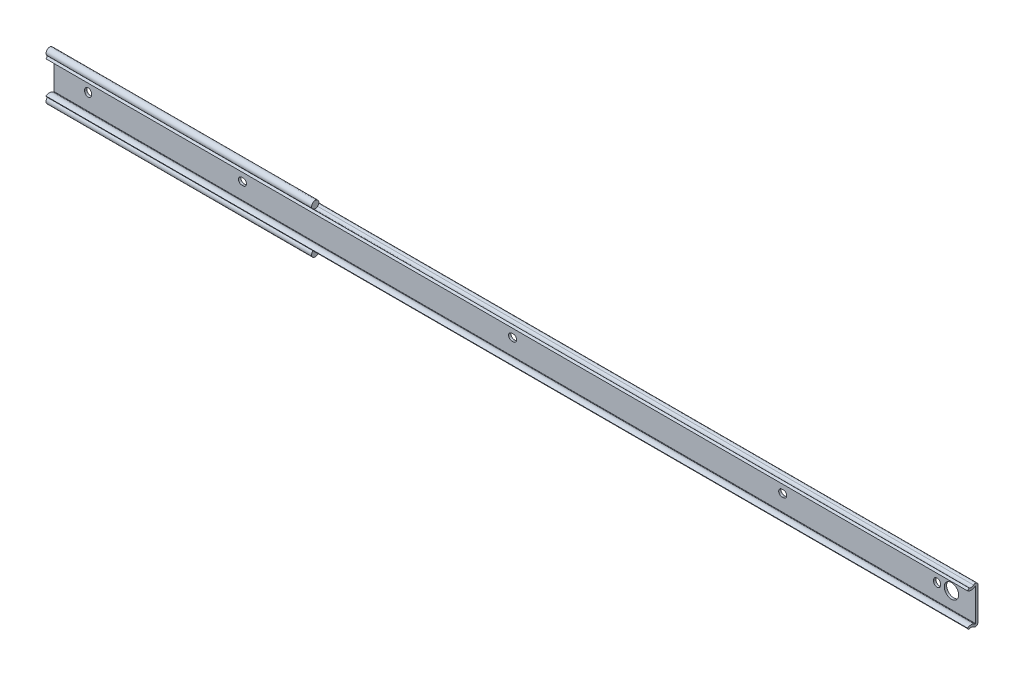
ISO-10303-21;
HEADER;
FILE_DESCRIPTION(('STEP AP214'),'2;1');
FILE_NAME('part.step','',(''),(''),'','','');
FILE_SCHEMA(('AUTOMOTIVE_DESIGN { 1 0 10303 214 1 1 1 1 }'));
ENDSEC;
DATA;
#1=APPLICATION_CONTEXT('core data for automotive mechanical design processes');
#2=APPLICATION_PROTOCOL_DEFINITION('international standard','automotive_design',2000,#1);
#3=PRODUCT_CONTEXT('',#1,'mechanical');
#4=PRODUCT('Part','Part','',(#3));
#5=PRODUCT_RELATED_PRODUCT_CATEGORY('part','',(#4));
#6=PRODUCT_DEFINITION_FORMATION('','',#4);
#7=PRODUCT_DEFINITION_CONTEXT('part definition',#1,'design');
#8=PRODUCT_DEFINITION('design','',#6,#7);
#9=PRODUCT_DEFINITION_SHAPE('','',#8);
#10=(LENGTH_UNIT() NAMED_UNIT(*) SI_UNIT(.MILLI.,.METRE.));
#11=(NAMED_UNIT(*) PLANE_ANGLE_UNIT() SI_UNIT($,.RADIAN.));
#12=(NAMED_UNIT(*) SI_UNIT($,.STERADIAN.) SOLID_ANGLE_UNIT());
#13=UNCERTAINTY_MEASURE_WITH_UNIT(LENGTH_MEASURE(1.E-05),#10,'distance_accuracy_value','');
#14=(GEOMETRIC_REPRESENTATION_CONTEXT(3) GLOBAL_UNCERTAINTY_ASSIGNED_CONTEXT((#13)) GLOBAL_UNIT_ASSIGNED_CONTEXT((#10,
#11,#12)) REPRESENTATION_CONTEXT('',''));
#15=CARTESIAN_POINT('',(0.,0.,0.));
#16=DIRECTION('',(0.,0.,1.));
#17=DIRECTION('',(1.,0.,0.));
#18=AXIS2_PLACEMENT_3D('',#15,#16,#17);
#19=CARTESIAN_POINT('',(584.2,10.6847650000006,1.74000019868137));
#20=DIRECTION('',(-1.,0.,0.));
#21=DIRECTION('',(0.,0.,1.));
#22=AXIS2_PLACEMENT_3D('',#19,#20,#21);
#23=CYLINDRICAL_SURFACE('',#22,1.7400001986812);
#24=CARTESIAN_POINT('',(-22.4,10.6847650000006,1.74000019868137));
#25=DIRECTION('',(1.,0.,0.));
#26=DIRECTION('',(0.,0.,-1.));
#27=AXIS2_PLACEMENT_3D('',#24,#25,#26);
#28=CIRCLE('',#27,1.7400001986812);
#29=CARTESIAN_POINT('',(-22.4,12.421670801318,1.84372545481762));
#30=VERTEX_POINT('',#29);
#31=CARTESIAN_POINT('',(-22.4,12.1726708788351,2.64207380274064));
#32=VERTEX_POINT('',#31);
#33=EDGE_CURVE('E275',#30,#32,#28,.T.);
#34=ORIENTED_EDGE('',*,*,#33,.T.);
#35=DIRECTION('',(-1.,0.,0.));
#36=VECTOR('',#35,1.);
#37=CARTESIAN_POINT('',(65.,12.1726708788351,2.64207380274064));
#38=LINE('',#37,#36);
#39=CARTESIAN_POINT('',(152.4,12.1726708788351,2.64207380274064));
#40=VERTEX_POINT('',#39);
#41=EDGE_CURVE('E492',#32,#40,#38,.F.);
#42=ORIENTED_EDGE('',*,*,#41,.T.);
#43=CARTESIAN_POINT('',(152.4,10.6847650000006,1.74000019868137));
#44=DIRECTION('',(-1.,0.,0.));
#45=DIRECTION('',(0.,0.,1.));
#46=AXIS2_PLACEMENT_3D('',#43,#44,#45);
#47=CIRCLE('',#46,1.7400001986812);
#48=CARTESIAN_POINT('',(152.4,11.9768810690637,2.90534853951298));
#49=VERTEX_POINT('',#48);
#50=EDGE_CURVE('E488',#49,#40,#47,.T.);
#51=ORIENTED_EDGE('',*,*,#50,.F.);
#52=DIRECTION('',(-1.,0.,0.));
#53=VECTOR('',#52,1.);
#54=CARTESIAN_POINT('',(584.2,11.9768810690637,2.90534853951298));
#55=LINE('',#54,#53);
#56=CARTESIAN_POINT('',(584.2,11.9768810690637,2.90534853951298));
#57=VERTEX_POINT('',#56);
#58=EDGE_CURVE('E365',#57,#49,#55,.T.);
#59=ORIENTED_EDGE('',*,*,#58,.F.);
#60=CARTESIAN_POINT('',(584.2,10.6847650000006,1.74000019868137));
#61=DIRECTION('',(1.,0.,0.));
#62=DIRECTION('',(0.,0.,-1.));
#63=AXIS2_PLACEMENT_3D('',#60,#61,#62);
#64=CIRCLE('',#63,1.7400001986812);
#65=CARTESIAN_POINT('',(584.2,12.421670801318,1.84372545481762));
#66=VERTEX_POINT('',#65);
#67=EDGE_CURVE('E272',#66,#57,#64,.T.);
#68=ORIENTED_EDGE('',*,*,#67,.F.);
#69=CARTESIAN_POINT('',(584.2,10.6847650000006,1.74000019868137));
#70=DIRECTION('',(-1.,0.,0.));
#71=DIRECTION('',(0.,0.998221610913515,0.0596122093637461));
#72=AXIS2_PLACEMENT_3D('',#69,#70,#71);
#73=CIRCLE('',#72,1.7400001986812);
#74=CARTESIAN_POINT('',(584.2,12.421670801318,1.63627494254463));
#75=VERTEX_POINT('',#74);
#76=EDGE_CURVE('E263',#66,#75,#73,.T.);
#77=ORIENTED_EDGE('',*,*,#76,.T.);
#78=CARTESIAN_POINT('',(584.2,10.6847650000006,0.));
#79=VERTEX_POINT('',#78);
#80=EDGE_CURVE('E260',#79,#75,#64,.T.);
#81=ORIENTED_EDGE('',*,*,#80,.F.);
#82=DIRECTION('',(-1.,0.,0.));
#83=VECTOR('',#82,1.);
#84=CARTESIAN_POINT('',(584.2,10.6847650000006,0.));
#85=LINE('',#84,#83);
#86=CARTESIAN_POINT('',(-22.4,10.6847650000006,0.));
#87=VERTEX_POINT('',#86);
#88=EDGE_CURVE('E397',#79,#87,#85,.T.);
#89=ORIENTED_EDGE('',*,*,#88,.T.);
#90=CARTESIAN_POINT('',(-22.4,12.421670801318,1.63627494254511));
#91=VERTEX_POINT('',#90);
#92=EDGE_CURVE('E292',#87,#91,#28,.T.);
#93=ORIENTED_EDGE('',*,*,#92,.T.);
#94=CARTESIAN_POINT('',(-22.4,10.6847650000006,1.74000019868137));
#95=DIRECTION('',(1.,0.,0.));
#96=DIRECTION('',(0.,0.998221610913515,-0.0596122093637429));
#97=AXIS2_PLACEMENT_3D('',#94,#95,#96);
#98=CIRCLE('',#97,1.7400001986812);
#99=EDGE_CURVE('E289',#91,#30,#98,.T.);
#100=ORIENTED_EDGE('',*,*,#99,.T.);
#101=EDGE_LOOP('',(#34,#42,#51,#59,#68,#77,#81,#89,#93,#100));
#102=FACE_BOUND('',#101,.T.);
#103=ADVANCED_FACE('F14',(#102),#23,.T.);
#104=CARTESIAN_POINT('',(584.2,10.6847650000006,1.74000019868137));
#105=DIRECTION('',(1.,0.,0.));
#106=DIRECTION('',(0.,0.,-1.));
#107=AXIS2_PLACEMENT_3D('',#104,#105,#106);
#108=PLANE('',#107);
#109=DIRECTION('',(0.,1.,0.));
#110=VECTOR('',#109,1.);
#111=CARTESIAN_POINT('',(584.2,-10.6847650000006,0.));
#112=LINE('',#111,#110);
#113=CARTESIAN_POINT('',(584.2,-10.6847650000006,0.));
#114=VERTEX_POINT('',#113);
#115=EDGE_CURVE('E267',#114,#79,#112,.T.);
#116=ORIENTED_EDGE('',*,*,#115,.T.);
#117=ORIENTED_EDGE('',*,*,#80,.T.);
#118=ORIENTED_EDGE('',*,*,#76,.F.);
#119=ORIENTED_EDGE('',*,*,#67,.T.);
#120=CARTESIAN_POINT('',(584.2,13.7450000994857,4.50000028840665));
#121=DIRECTION('',(-1.,0.,0.));
#122=DIRECTION('',(0.,0.,-1.));
#123=AXIS2_PLACEMENT_3D('',#120,#121,#122);
#124=CIRCLE('',#123,2.38099960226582);
#125=CARTESIAN_POINT('',(584.2,11.8434490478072,5.93292132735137));
#126=VERTEX_POINT('',#125);
#127=EDGE_CURVE('E271',#57,#126,#124,.T.);
#128=ORIENTED_EDGE('',*,*,#127,.T.);
#129=DIRECTION('',(0.,-0.798635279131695,0.601815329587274));
#130=VECTOR('',#129,1.);
#131=CARTESIAN_POINT('',(584.2,10.6055642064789,6.86573520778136));
#132=LINE('',#131,#130);
#133=CARTESIAN_POINT('',(584.2,10.6055642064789,6.86573520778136));
#134=VERTEX_POINT('',#133);
#135=EDGE_CURVE('E415',#126,#134,#132,.T.);
#136=ORIENTED_EDGE('',*,*,#135,.T.);
#137=CARTESIAN_POINT('',(584.2,13.7450000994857,4.50000028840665));
#138=DIRECTION('',(1.,0.,0.));
#139=DIRECTION('',(0.,0.,-1.));
#140=AXIS2_PLACEMENT_3D('',#137,#138,#139);
#141=CIRCLE('',#140,3.9309998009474);
#142=CARTESIAN_POINT('',(584.2,10.8258581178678,1.86725086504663));
#143=VERTEX_POINT('',#142);
#144=EDGE_CURVE('E414',#134,#143,#141,.T.);
#145=ORIENTED_EDGE('',*,*,#144,.T.);
#146=CARTESIAN_POINT('',(584.2,10.6847650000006,1.74000019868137));
#147=DIRECTION('',(-1.,0.,0.));
#148=DIRECTION('',(0.,0.,-1.));
#149=AXIS2_PLACEMENT_3D('',#146,#147,#148);
#150=CIRCLE('',#149,0.18999999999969);
#151=CARTESIAN_POINT('',(584.2,10.6847650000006,1.55000019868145));
#152=VERTEX_POINT('',#151);
#153=EDGE_CURVE('E412',#143,#152,#150,.T.);
#154=ORIENTED_EDGE('',*,*,#153,.T.);
#155=DIRECTION('',(0.,-1.,0.));
#156=VECTOR('',#155,1.);
#157=CARTESIAN_POINT('',(584.2,-10.6847650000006,1.55000019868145));
#158=LINE('',#157,#156);
#159=CARTESIAN_POINT('',(584.2,-10.6847650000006,1.55000019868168));
#160=VERTEX_POINT('',#159);
#161=EDGE_CURVE('E410',#152,#160,#158,.T.);
#162=ORIENTED_EDGE('',*,*,#161,.T.);
#163=CARTESIAN_POINT('',(584.2,-10.6847650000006,1.74000019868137));
#164=DIRECTION('',(-1.,0.,0.));
#165=DIRECTION('',(0.,0.,1.));
#166=AXIS2_PLACEMENT_3D('',#163,#164,#165);
#167=CIRCLE('',#166,0.18999999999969);
#168=CARTESIAN_POINT('',(584.2,-10.8258581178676,1.86725086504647));
#169=VERTEX_POINT('',#168);
#170=EDGE_CURVE('E408',#160,#169,#167,.T.);
#171=ORIENTED_EDGE('',*,*,#170,.T.);
#172=CARTESIAN_POINT('',(584.2,-13.7450000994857,4.50000028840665));
#173=DIRECTION('',(1.,0.,0.));
#174=DIRECTION('',(0.,0.,1.));
#175=AXIS2_PLACEMENT_3D('',#172,#173,#174);
#176=CIRCLE('',#175,3.9309998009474);
#177=CARTESIAN_POINT('',(584.2,-10.6055642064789,6.86573520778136));
#178=VERTEX_POINT('',#177);
#179=EDGE_CURVE('E406',#169,#178,#176,.T.);
#180=ORIENTED_EDGE('',*,*,#179,.T.);
#181=DIRECTION('',(0.,-0.798635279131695,-0.601815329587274));
#182=VECTOR('',#181,1.);
#183=CARTESIAN_POINT('',(584.2,-10.6055642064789,6.86573520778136));
#184=LINE('',#183,#182);
#185=CARTESIAN_POINT('',(584.2,-11.8434490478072,5.93292132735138));
#186=VERTEX_POINT('',#185);
#187=EDGE_CURVE('E404',#178,#186,#184,.T.);
#188=ORIENTED_EDGE('',*,*,#187,.T.);
#189=CARTESIAN_POINT('',(584.2,-13.7450000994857,4.50000028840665));
#190=DIRECTION('',(-1.,0.,0.));
#191=DIRECTION('',(0.,0.,1.));
#192=AXIS2_PLACEMENT_3D('',#189,#190,#191);
#193=CIRCLE('',#192,2.38099960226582);
#194=CARTESIAN_POINT('',(584.2,-11.9768810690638,2.90534853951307));
#195=VERTEX_POINT('',#194);
#196=EDGE_CURVE('E402',#186,#195,#193,.T.);
#197=ORIENTED_EDGE('',*,*,#196,.T.);
#198=CARTESIAN_POINT('',(584.2,-10.6847650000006,1.74000019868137));
#199=DIRECTION('',(1.,0.,0.));
#200=DIRECTION('',(0.,0.,1.));
#201=AXIS2_PLACEMENT_3D('',#198,#199,#200);
#202=CIRCLE('',#201,1.7400001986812);
#203=EDGE_CURVE('E400',#195,#114,#202,.T.);
#204=ORIENTED_EDGE('',*,*,#203,.T.);
#205=EDGE_LOOP('',(#116,#117,#118,#119,#128,#136,#145,#154,#162,#171,#180,#188,#197,#204));
#206=FACE_BOUND('',#205,.T.);
#207=ADVANCED_FACE('F262',(#206),#108,.T.);
#208=CARTESIAN_POINT('',(-22.4,10.6847650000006,1.74000019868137));
#209=DIRECTION('',(1.,0.,0.));
#210=DIRECTION('',(0.,0.,-1.));
#211=AXIS2_PLACEMENT_3D('',#208,#209,#210);
#212=PLANE('',#211);
#213=CARTESIAN_POINT('',(-22.4,13.745,4.45));
#214=DIRECTION('',(-1.,0.,0.));
#215=DIRECTION('',(0.,0.,1.));
#216=AXIS2_PLACEMENT_3D('',#213,#214,#215);
#217=CIRCLE('',#216,2.396);
#218=CARTESIAN_POINT('',(-22.4,11.4666473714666,5.19156948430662));
#219=VERTEX_POINT('',#218);
#220=EDGE_CURVE('E484',#219,#32,#217,.T.);
#221=ORIENTED_EDGE('',*,*,#220,.T.);
#222=ORIENTED_EDGE('',*,*,#33,.F.);
#223=ORIENTED_EDGE('',*,*,#99,.F.);
#224=ORIENTED_EDGE('',*,*,#92,.F.);
#225=DIRECTION('',(0.,1.,0.));
#226=VECTOR('',#225,1.);
#227=CARTESIAN_POINT('',(-22.4,-10.6847650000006,0.));
#228=LINE('',#227,#226);
#229=CARTESIAN_POINT('',(-22.4,-10.6847650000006,0.));
#230=VERTEX_POINT('',#229);
#231=EDGE_CURVE('E318',#230,#87,#228,.T.);
#232=ORIENTED_EDGE('',*,*,#231,.F.);
#233=CARTESIAN_POINT('',(-22.4,-10.6847650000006,1.74000019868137));
#234=DIRECTION('',(1.,0.,0.));
#235=DIRECTION('',(0.,0.,1.));
#236=AXIS2_PLACEMENT_3D('',#233,#234,#235);
#237=CIRCLE('',#236,1.7400001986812);
#238=CARTESIAN_POINT('',(-22.4,-12.1726708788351,2.64207380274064));
#239=VERTEX_POINT('',#238);
#240=EDGE_CURVE('E316',#239,#230,#237,.T.);
#241=ORIENTED_EDGE('',*,*,#240,.F.);
#242=CARTESIAN_POINT('',(-22.4,-13.745,4.45));
#243=DIRECTION('',(-1.,0.,0.));
#244=DIRECTION('',(0.,0.,-1.));
#245=AXIS2_PLACEMENT_3D('',#242,#243,#244);
#246=CIRCLE('',#245,2.396);
#247=CARTESIAN_POINT('',(-22.4,-11.4666473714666,5.19156948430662));
#248=VERTEX_POINT('',#247);
#249=EDGE_CURVE('E466',#239,#248,#246,.T.);
#250=ORIENTED_EDGE('',*,*,#249,.T.);
#251=CARTESIAN_POINT('',(-22.4,-13.7450000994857,4.50000028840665));
#252=DIRECTION('',(-1.,0.,0.));
#253=DIRECTION('',(0.,0.,1.));
#254=AXIS2_PLACEMENT_3D('',#251,#252,#253);
#255=CIRCLE('',#254,2.38099960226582);
#256=CARTESIAN_POINT('',(-22.4,-11.8434490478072,5.93292132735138));
#257=VERTEX_POINT('',#256);
#258=EDGE_CURVE('E37',#257,#248,#255,.T.);
#259=ORIENTED_EDGE('',*,*,#258,.F.);
#260=DIRECTION('',(0.,-0.798635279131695,-0.601815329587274));
#261=VECTOR('',#260,1.);
#262=CARTESIAN_POINT('',(-22.4,-10.6055642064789,6.86573520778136));
#263=LINE('',#262,#261);
#264=CARTESIAN_POINT('',(-22.4,-10.6055642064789,6.86573520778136));
#265=VERTEX_POINT('',#264);
#266=EDGE_CURVE('E313',#265,#257,#263,.T.);
#267=ORIENTED_EDGE('',*,*,#266,.F.);
#268=CARTESIAN_POINT('',(-22.4,-13.7450000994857,4.50000028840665));
#269=DIRECTION('',(1.,0.,0.));
#270=DIRECTION('',(0.,0.,1.));
#271=AXIS2_PLACEMENT_3D('',#268,#269,#270);
#272=CIRCLE('',#271,3.9309998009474);
#273=CARTESIAN_POINT('',(-22.4,-10.8258581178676,1.86725086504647));
#274=VERTEX_POINT('',#273);
#275=EDGE_CURVE('E311',#274,#265,#272,.T.);
#276=ORIENTED_EDGE('',*,*,#275,.F.);
#277=CARTESIAN_POINT('',(-22.4,-10.6847650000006,1.74000019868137));
#278=DIRECTION('',(-1.,0.,0.));
#279=DIRECTION('',(0.,0.,1.));
#280=AXIS2_PLACEMENT_3D('',#277,#278,#279);
#281=CIRCLE('',#280,0.18999999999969);
#282=CARTESIAN_POINT('',(-22.4,-10.6847650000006,1.55000019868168));
#283=VERTEX_POINT('',#282);
#284=EDGE_CURVE('E309',#283,#274,#281,.T.);
#285=ORIENTED_EDGE('',*,*,#284,.F.);
#286=DIRECTION('',(0.,-1.,0.));
#287=VECTOR('',#286,1.);
#288=CARTESIAN_POINT('',(-22.4,-10.6847650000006,1.55000019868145));
#289=LINE('',#288,#287);
#290=CARTESIAN_POINT('',(-22.4,10.6847650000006,1.55000019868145));
#291=VERTEX_POINT('',#290);
#292=EDGE_CURVE('E307',#291,#283,#289,.T.);
#293=ORIENTED_EDGE('',*,*,#292,.F.);
#294=CARTESIAN_POINT('',(-22.4,10.6847650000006,1.74000019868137));
#295=DIRECTION('',(-1.,0.,0.));
#296=DIRECTION('',(0.,0.,-1.));
#297=AXIS2_PLACEMENT_3D('',#294,#295,#296);
#298=CIRCLE('',#297,0.18999999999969);
#299=CARTESIAN_POINT('',(-22.4,10.8258581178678,1.86725086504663));
#300=VERTEX_POINT('',#299);
#301=EDGE_CURVE('E305',#300,#291,#298,.T.);
#302=ORIENTED_EDGE('',*,*,#301,.F.);
#303=CARTESIAN_POINT('',(-22.4,13.7450000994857,4.50000028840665));
#304=DIRECTION('',(1.,0.,0.));
#305=DIRECTION('',(0.,0.,-1.));
#306=AXIS2_PLACEMENT_3D('',#303,#304,#305);
#307=CIRCLE('',#306,3.9309998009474);
#308=CARTESIAN_POINT('',(-22.4,10.6055642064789,6.86573520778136));
#309=VERTEX_POINT('',#308);
#310=EDGE_CURVE('E303',#309,#300,#307,.T.);
#311=ORIENTED_EDGE('',*,*,#310,.F.);
#312=DIRECTION('',(0.,-0.798635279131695,0.601815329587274));
#313=VECTOR('',#312,1.);
#314=CARTESIAN_POINT('',(-22.4,10.6055642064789,6.86573520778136));
#315=LINE('',#314,#313);
#316=CARTESIAN_POINT('',(-22.4,11.8434490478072,5.93292132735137));
#317=VERTEX_POINT('',#316);
#318=EDGE_CURVE('E301',#317,#309,#315,.T.);
#319=ORIENTED_EDGE('',*,*,#318,.F.);
#320=CARTESIAN_POINT('',(-22.4,13.7450000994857,4.50000028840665));
#321=DIRECTION('',(-1.,0.,0.));
#322=DIRECTION('',(0.,0.,-1.));
#323=AXIS2_PLACEMENT_3D('',#320,#321,#322);
#324=CIRCLE('',#323,2.38099960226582);
#325=EDGE_CURVE('E298',#219,#317,#324,.T.);
#326=ORIENTED_EDGE('',*,*,#325,.F.);
#327=EDGE_LOOP('',(#221,#222,#223,#224,#232,#241,#250,#259,#267,#276,#285,#293,#302,#311,#319,#326));
#328=FACE_BOUND('',#327,.T.);
#329=ADVANCED_FACE('F332',(#328),#212,.F.);
#330=CARTESIAN_POINT('',(584.2,13.7450000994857,4.50000028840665));
#331=DIRECTION('',(-1.,0.,0.));
#332=DIRECTION('',(0.,0.,1.));
#333=AXIS2_PLACEMENT_3D('',#330,#331,#332);
#334=CYLINDRICAL_SURFACE('',#333,2.38099960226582);
#335=CARTESIAN_POINT('',(152.4,13.7450000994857,4.50000028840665));
#336=DIRECTION('',(-1.,0.,0.));
#337=DIRECTION('',(0.,0.,1.));
#338=AXIS2_PLACEMENT_3D('',#335,#336,#337);
#339=CIRCLE('',#338,2.38099960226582);
#340=CARTESIAN_POINT('',(152.4,11.4666473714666,5.19156948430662));
#341=VERTEX_POINT('',#340);
#342=EDGE_CURVE('E362',#341,#49,#339,.F.);
#343=ORIENTED_EDGE('',*,*,#342,.F.);
#344=DIRECTION('',(-1.,0.,0.));
#345=VECTOR('',#344,1.);
#346=CARTESIAN_POINT('',(65.,11.4666473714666,5.19156948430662));
#347=LINE('',#346,#345);
#348=EDGE_CURVE('E359',#341,#219,#347,.T.);
#349=ORIENTED_EDGE('',*,*,#348,.T.);
#350=ORIENTED_EDGE('',*,*,#325,.T.);
#351=DIRECTION('',(-1.,0.,0.));
#352=VECTOR('',#351,1.);
#353=CARTESIAN_POINT('',(584.2,11.8434490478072,5.93292132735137));
#354=LINE('',#353,#352);
#355=EDGE_CURVE('E368',#126,#317,#354,.T.);
#356=ORIENTED_EDGE('',*,*,#355,.F.);
#357=ORIENTED_EDGE('',*,*,#127,.F.);
#358=ORIENTED_EDGE('',*,*,#58,.T.);
#359=EDGE_LOOP('',(#343,#349,#350,#356,#357,#358));
#360=FACE_BOUND('',#359,.T.);
#361=ADVANCED_FACE('F342',(#360),#334,.F.);
#362=CARTESIAN_POINT('',(584.2,10.6055642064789,6.86573520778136));
#363=DIRECTION('',(0.,-0.601815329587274,-0.798635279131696));
#364=DIRECTION('',(0.,0.798635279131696,-0.601815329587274));
#365=AXIS2_PLACEMENT_3D('',#362,#363,#364);
#366=PLANE('',#365);
#367=ORIENTED_EDGE('',*,*,#318,.T.);
#368=DIRECTION('',(-1.,0.,0.));
#369=VECTOR('',#368,1.);
#370=CARTESIAN_POINT('',(584.2,10.6055642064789,6.86573520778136));
#371=LINE('',#370,#369);
#372=EDGE_CURVE('E371',#134,#309,#371,.T.);
#373=ORIENTED_EDGE('',*,*,#372,.F.);
#374=ORIENTED_EDGE('',*,*,#135,.F.);
#375=ORIENTED_EDGE('',*,*,#355,.T.);
#376=EDGE_LOOP('',(#367,#373,#374,#375));
#377=FACE_BOUND('',#376,.T.);
#378=ADVANCED_FACE('F423',(#377),#366,.F.);
#379=CARTESIAN_POINT('',(584.2,13.7450000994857,4.50000028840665));
#380=DIRECTION('',(-1.,0.,0.));
#381=DIRECTION('',(0.,0.,1.));
#382=AXIS2_PLACEMENT_3D('',#379,#380,#381);
#383=CYLINDRICAL_SURFACE('',#382,3.9309998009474);
#384=ORIENTED_EDGE('',*,*,#310,.T.);
#385=DIRECTION('',(-1.,0.,0.));
#386=VECTOR('',#385,1.);
#387=CARTESIAN_POINT('',(584.2,10.8258581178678,1.86725086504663));
#388=LINE('',#387,#386);
#389=EDGE_CURVE('E374',#143,#300,#388,.T.);
#390=ORIENTED_EDGE('',*,*,#389,.F.);
#391=ORIENTED_EDGE('',*,*,#144,.F.);
#392=ORIENTED_EDGE('',*,*,#372,.T.);
#393=EDGE_LOOP('',(#384,#390,#391,#392));
#394=FACE_BOUND('',#393,.T.);
#395=ADVANCED_FACE('F428',(#394),#383,.T.);
#396=CARTESIAN_POINT('',(584.2,10.6847650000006,1.74000019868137));
#397=DIRECTION('',(-1.,0.,0.));
#398=DIRECTION('',(0.,0.,1.));
#399=AXIS2_PLACEMENT_3D('',#396,#397,#398);
#400=CYLINDRICAL_SURFACE('',#399,0.18999999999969);
#401=ORIENTED_EDGE('',*,*,#301,.T.);
#402=DIRECTION('',(-1.,0.,0.));
#403=VECTOR('',#402,1.);
#404=CARTESIAN_POINT('',(584.2,10.6847650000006,1.55000019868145));
#405=LINE('',#404,#403);
#406=EDGE_CURVE('E377',#152,#291,#405,.T.);
#407=ORIENTED_EDGE('',*,*,#406,.F.);
#408=ORIENTED_EDGE('',*,*,#153,.F.);
#409=ORIENTED_EDGE('',*,*,#389,.T.);
#410=EDGE_LOOP('',(#401,#407,#408,#409));
#411=FACE_BOUND('',#410,.T.);
#412=ADVANCED_FACE('F434',(#411),#400,.F.);
#413=CARTESIAN_POINT('',(584.2,-10.6847650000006,1.55000019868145));
#414=DIRECTION('',(0.,0.,-1.));
#415=DIRECTION('',(-1.,0.,0.));
#416=AXIS2_PLACEMENT_3D('',#413,#414,#415);
#417=PLANE('',#416);
#418=CARTESIAN_POINT('',(568.3,0.,1.55000019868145));
#419=DIRECTION('',(0.,0.,-1.));
#420=DIRECTION('',(-1.,0.,0.));
#421=AXIS2_PLACEMENT_3D('',#418,#419,#420);
#422=CIRCLE('',#421,4.75);
#423=CARTESIAN_POINT('',(563.55,0.,1.55000019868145));
#424=VERTEX_POINT('',#423);
#425=EDGE_CURVE('E474',#424,#424,#422,.T.);
#426=ORIENTED_EDGE('',*,*,#425,.T.);
#427=EDGE_LOOP('',(#426));
#428=FACE_BOUND('',#427,.T.);
#429=DIRECTION('',(0.,-1.,0.));
#430=VECTOR('',#429,1.);
#431=CARTESIAN_POINT('',(-2.25,-0.4,1.55000019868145));
#432=LINE('',#431,#430);
#433=CARTESIAN_POINT('',(-2.25,0.4,1.55000019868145));
#434=VERTEX_POINT('',#433);
#435=CARTESIAN_POINT('',(-2.25,-0.4,1.55000019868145));
#436=VERTEX_POINT('',#435);
#437=EDGE_CURVE('E496',#434,#436,#432,.T.);
#438=ORIENTED_EDGE('',*,*,#437,.F.);
#439=CARTESIAN_POINT('',(0.,0.4,1.55000019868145));
#440=DIRECTION('',(0.,0.,-1.));
#441=DIRECTION('',(-1.,0.,0.));
#442=AXIS2_PLACEMENT_3D('',#439,#440,#441);
#443=CIRCLE('',#442,2.24999999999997);
#444=CARTESIAN_POINT('',(2.25,0.4,1.55000019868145));
#445=VERTEX_POINT('',#444);
#446=EDGE_CURVE('E499',#445,#434,#443,.F.);
#447=ORIENTED_EDGE('',*,*,#446,.F.);
#448=DIRECTION('',(0.,1.,0.));
#449=VECTOR('',#448,1.);
#450=CARTESIAN_POINT('',(2.25,0.4,1.55000019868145));
#451=LINE('',#450,#449);
#452=CARTESIAN_POINT('',(2.25,-0.4,1.55000019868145));
#453=VERTEX_POINT('',#452);
#454=EDGE_CURVE('E516',#453,#445,#451,.T.);
#455=ORIENTED_EDGE('',*,*,#454,.F.);
#456=CARTESIAN_POINT('',(0.,-0.4,1.55000019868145));
#457=DIRECTION('',(0.,0.,-1.));
#458=DIRECTION('',(-1.,0.,0.));
#459=AXIS2_PLACEMENT_3D('',#456,#457,#458);
#460=CIRCLE('',#459,2.24999999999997);
#461=EDGE_CURVE('E494',#436,#453,#460,.F.);
#462=ORIENTED_EDGE('',*,*,#461,.F.);
#463=EDGE_LOOP('',(#438,#447,#455,#462));
#464=FACE_BOUND('',#463,.T.);
#465=DIRECTION('',(-1.,0.,0.));
#466=VECTOR('',#465,1.);
#467=CARTESIAN_POINT('',(102.000000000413,2.24999999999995,1.55000019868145));
#468=LINE('',#467,#466);
#469=CARTESIAN_POINT('',(102.000000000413,2.24999999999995,1.55000019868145));
#470=VERTEX_POINT('',#469);
#471=CARTESIAN_POINT('',(101.200000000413,2.24999999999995,1.55000019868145));
#472=VERTEX_POINT('',#471);
#473=EDGE_CURVE('E527',#470,#472,#468,.T.);
#474=ORIENTED_EDGE('',*,*,#473,.F.);
#475=CARTESIAN_POINT('',(102.000000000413,0.,1.55000019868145));
#476=DIRECTION('',(0.,0.,-1.));
#477=DIRECTION('',(-1.,0.,0.));
#478=AXIS2_PLACEMENT_3D('',#475,#476,#477);
#479=CIRCLE('',#478,2.24999999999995);
#480=CARTESIAN_POINT('',(102.000000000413,-2.24999999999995,1.55000019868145));
#481=VERTEX_POINT('',#480);
#482=EDGE_CURVE('E530',#481,#470,#479,.F.);
#483=ORIENTED_EDGE('',*,*,#482,.F.);
#484=DIRECTION('',(1.,0.,0.));
#485=VECTOR('',#484,1.);
#486=CARTESIAN_POINT('',(102.000000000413,-2.24999999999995,1.55000019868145));
#487=LINE('',#486,#485);
#488=CARTESIAN_POINT('',(101.200000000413,-2.24999999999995,1.55000019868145));
#489=VERTEX_POINT('',#488);
#490=EDGE_CURVE('E547',#489,#481,#487,.T.);
#491=ORIENTED_EDGE('',*,*,#490,.F.);
#492=CARTESIAN_POINT('',(101.200000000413,0.,1.55000019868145));
#493=DIRECTION('',(0.,0.,-1.));
#494=DIRECTION('',(-1.,0.,0.));
#495=AXIS2_PLACEMENT_3D('',#492,#493,#494);
#496=CIRCLE('',#495,2.24999999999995);
#497=EDGE_CURVE('E525',#472,#489,#496,.F.);
#498=ORIENTED_EDGE('',*,*,#497,.F.);
#499=EDGE_LOOP('',(#474,#483,#491,#498));
#500=FACE_BOUND('',#499,.T.);
#501=DIRECTION('',(-1.,0.,0.));
#502=VECTOR('',#501,1.);
#503=CARTESIAN_POINT('',(279.8,2.24999999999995,1.55000019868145));
#504=LINE('',#503,#502);
#505=CARTESIAN_POINT('',(279.8,2.24999999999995,1.55000019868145));
#506=VERTEX_POINT('',#505);
#507=CARTESIAN_POINT('',(279.,2.24999999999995,1.55000019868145));
#508=VERTEX_POINT('',#507);
#509=EDGE_CURVE('E558',#506,#508,#504,.T.);
#510=ORIENTED_EDGE('',*,*,#509,.F.);
#511=CARTESIAN_POINT('',(279.8,0.,1.55000019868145));
#512=DIRECTION('',(0.,0.,-1.));
#513=DIRECTION('',(-1.,0.,0.));
#514=AXIS2_PLACEMENT_3D('',#511,#512,#513);
#515=CIRCLE('',#514,2.24999999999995);
#516=CARTESIAN_POINT('',(279.8,-2.24999999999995,1.55000019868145));
#517=VERTEX_POINT('',#516);
#518=EDGE_CURVE('E561',#517,#506,#515,.F.);
#519=ORIENTED_EDGE('',*,*,#518,.F.);
#520=DIRECTION('',(1.,0.,0.));
#521=VECTOR('',#520,1.);
#522=CARTESIAN_POINT('',(279.8,-2.24999999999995,1.55000019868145));
#523=LINE('',#522,#521);
#524=CARTESIAN_POINT('',(279.,-2.24999999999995,1.55000019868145));
#525=VERTEX_POINT('',#524);
#526=EDGE_CURVE('E578',#525,#517,#523,.T.);
#527=ORIENTED_EDGE('',*,*,#526,.F.);
#528=CARTESIAN_POINT('',(279.,0.,1.55000019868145));
#529=DIRECTION('',(0.,0.,-1.));
#530=DIRECTION('',(-1.,0.,0.));
#531=AXIS2_PLACEMENT_3D('',#528,#529,#530);
#532=CIRCLE('',#531,2.24999999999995);
#533=EDGE_CURVE('E556',#508,#525,#532,.F.);
#534=ORIENTED_EDGE('',*,*,#533,.F.);
#535=EDGE_LOOP('',(#510,#519,#527,#534));
#536=FACE_BOUND('',#535,.T.);
#537=DIRECTION('',(-1.,0.,0.));
#538=VECTOR('',#537,1.);
#539=CARTESIAN_POINT('',(457.60000000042,2.24999999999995,1.55000019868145));
#540=LINE('',#539,#538);
#541=CARTESIAN_POINT('',(457.60000000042,2.24999999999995,1.55000019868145));
#542=VERTEX_POINT('',#541);
#543=CARTESIAN_POINT('',(456.80000000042,2.24999999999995,1.55000019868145));
#544=VERTEX_POINT('',#543);
#545=EDGE_CURVE('E589',#542,#544,#540,.T.);
#546=ORIENTED_EDGE('',*,*,#545,.F.);
#547=CARTESIAN_POINT('',(457.60000000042,0.,1.55000019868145));
#548=DIRECTION('',(0.,0.,-1.));
#549=DIRECTION('',(-1.,0.,0.));
#550=AXIS2_PLACEMENT_3D('',#547,#548,#549);
#551=CIRCLE('',#550,2.24999999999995);
#552=CARTESIAN_POINT('',(457.60000000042,-2.24999999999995,1.55000019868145));
#553=VERTEX_POINT('',#552);
#554=EDGE_CURVE('E592',#553,#542,#551,.F.);
#555=ORIENTED_EDGE('',*,*,#554,.F.);
#556=DIRECTION('',(1.,0.,0.));
#557=VECTOR('',#556,1.);
#558=CARTESIAN_POINT('',(457.60000000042,-2.24999999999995,1.55000019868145));
#559=LINE('',#558,#557);
#560=CARTESIAN_POINT('',(456.800000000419,-2.24999999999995,1.55000019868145));
#561=VERTEX_POINT('',#560);
#562=EDGE_CURVE('E609',#561,#553,#559,.T.);
#563=ORIENTED_EDGE('',*,*,#562,.F.);
#564=CARTESIAN_POINT('',(456.80000000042,0.,1.55000019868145));
#565=DIRECTION('',(0.,0.,-1.));
#566=DIRECTION('',(-1.,0.,0.));
#567=AXIS2_PLACEMENT_3D('',#564,#565,#566);
#568=CIRCLE('',#567,2.24999999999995);
#569=EDGE_CURVE('E587',#544,#561,#568,.F.);
#570=ORIENTED_EDGE('',*,*,#569,.F.);
#571=EDGE_LOOP('',(#546,#555,#563,#570));
#572=FACE_BOUND('',#571,.T.);
#573=DIRECTION('',(0.,-1.,0.));
#574=VECTOR('',#573,1.);
#575=CARTESIAN_POINT('',(556.55,-0.4,1.55000019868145));
#576=LINE('',#575,#574);
#577=CARTESIAN_POINT('',(556.55,0.4,1.55000019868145));
#578=VERTEX_POINT('',#577);
#579=CARTESIAN_POINT('',(556.55,-0.4,1.55000019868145));
#580=VERTEX_POINT('',#579);
#581=EDGE_CURVE('E620',#578,#580,#576,.T.);
#582=ORIENTED_EDGE('',*,*,#581,.F.);
#583=CARTESIAN_POINT('',(558.8,0.4,1.55000019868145));
#584=DIRECTION('',(0.,0.,-1.));
#585=DIRECTION('',(-1.,0.,0.));
#586=AXIS2_PLACEMENT_3D('',#583,#584,#585);
#587=CIRCLE('',#586,2.24999999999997);
#588=CARTESIAN_POINT('',(561.05,0.4,1.55000019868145));
#589=VERTEX_POINT('',#588);
#590=EDGE_CURVE('E623',#589,#578,#587,.F.);
#591=ORIENTED_EDGE('',*,*,#590,.F.);
#592=DIRECTION('',(0.,1.,0.));
#593=VECTOR('',#592,1.);
#594=CARTESIAN_POINT('',(561.05,0.4,1.55000019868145));
#595=LINE('',#594,#593);
#596=CARTESIAN_POINT('',(561.05,-0.4,1.55000019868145));
#597=VERTEX_POINT('',#596);
#598=EDGE_CURVE('E276',#597,#589,#595,.T.);
#599=ORIENTED_EDGE('',*,*,#598,.F.);
#600=CARTESIAN_POINT('',(558.8,-0.4,1.55000019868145));
#601=DIRECTION('',(0.,0.,-1.));
#602=DIRECTION('',(-1.,0.,0.));
#603=AXIS2_PLACEMENT_3D('',#600,#601,#602);
#604=CIRCLE('',#603,2.24999999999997);
#605=EDGE_CURVE('E618',#580,#597,#604,.F.);
#606=ORIENTED_EDGE('',*,*,#605,.F.);
#607=EDGE_LOOP('',(#582,#591,#599,#606));
#608=FACE_BOUND('',#607,.T.);
#609=ORIENTED_EDGE('',*,*,#292,.T.);
#610=DIRECTION('',(-1.,0.,0.));
#611=VECTOR('',#610,1.);
#612=CARTESIAN_POINT('',(584.2,-10.6847650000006,1.55000019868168));
#613=LINE('',#612,#611);
#614=EDGE_CURVE('E380',#160,#283,#613,.T.);
#615=ORIENTED_EDGE('',*,*,#614,.F.);
#616=ORIENTED_EDGE('',*,*,#161,.F.);
#617=ORIENTED_EDGE('',*,*,#406,.T.);
#618=EDGE_LOOP('',(#609,#615,#616,#617));
#619=FACE_BOUND('',#618,.T.);
#620=ADVANCED_FACE('F438',(#428,#464,#500,#536,#572,#608,#619),#417,.F.);
#621=CARTESIAN_POINT('',(584.2,-10.6847650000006,1.74000019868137));
#622=DIRECTION('',(-1.,0.,0.));
#623=DIRECTION('',(0.,0.,1.));
#624=AXIS2_PLACEMENT_3D('',#621,#622,#623);
#625=CYLINDRICAL_SURFACE('',#624,0.18999999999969);
#626=ORIENTED_EDGE('',*,*,#284,.T.);
#627=DIRECTION('',(-1.,0.,0.));
#628=VECTOR('',#627,1.);
#629=CARTESIAN_POINT('',(584.2,-10.8258581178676,1.86725086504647));
#630=LINE('',#629,#628);
#631=EDGE_CURVE('E383',#169,#274,#630,.T.);
#632=ORIENTED_EDGE('',*,*,#631,.F.);
#633=ORIENTED_EDGE('',*,*,#170,.F.);
#634=ORIENTED_EDGE('',*,*,#614,.T.);
#635=EDGE_LOOP('',(#626,#632,#633,#634));
#636=FACE_BOUND('',#635,.T.);
#637=ADVANCED_FACE('F443',(#636),#625,.F.);
#638=CARTESIAN_POINT('',(584.2,-13.7450000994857,4.50000028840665));
#639=DIRECTION('',(-1.,0.,0.));
#640=DIRECTION('',(0.,0.,1.));
#641=AXIS2_PLACEMENT_3D('',#638,#639,#640);
#642=CYLINDRICAL_SURFACE('',#641,3.9309998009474);
#643=ORIENTED_EDGE('',*,*,#275,.T.);
#644=DIRECTION('',(-1.,0.,0.));
#645=VECTOR('',#644,1.);
#646=CARTESIAN_POINT('',(584.2,-10.6055642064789,6.86573520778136));
#647=LINE('',#646,#645);
#648=EDGE_CURVE('E386',#178,#265,#647,.T.);
#649=ORIENTED_EDGE('',*,*,#648,.F.);
#650=ORIENTED_EDGE('',*,*,#179,.F.);
#651=ORIENTED_EDGE('',*,*,#631,.T.);
#652=EDGE_LOOP('',(#643,#649,#650,#651));
#653=FACE_BOUND('',#652,.T.);
#654=ADVANCED_FACE('F449',(#653),#642,.T.);
#655=CARTESIAN_POINT('',(584.2,-10.6055642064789,6.86573520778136));
#656=DIRECTION('',(0.,0.601815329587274,-0.798635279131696));
#657=DIRECTION('',(0.,0.798635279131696,0.601815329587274));
#658=AXIS2_PLACEMENT_3D('',#655,#656,#657);
#659=PLANE('',#658);
#660=ORIENTED_EDGE('',*,*,#266,.T.);
#661=DIRECTION('',(-1.,0.,0.));
#662=VECTOR('',#661,1.);
#663=CARTESIAN_POINT('',(584.2,-11.8434490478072,5.93292132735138));
#664=LINE('',#663,#662);
#665=EDGE_CURVE('E389',#186,#257,#664,.T.);
#666=ORIENTED_EDGE('',*,*,#665,.F.);
#667=ORIENTED_EDGE('',*,*,#187,.F.);
#668=ORIENTED_EDGE('',*,*,#648,.T.);
#669=EDGE_LOOP('',(#660,#666,#667,#668));
#670=FACE_BOUND('',#669,.T.);
#671=ADVANCED_FACE('F453',(#670),#659,.F.);
#672=CARTESIAN_POINT('',(584.2,-13.7450000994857,4.50000028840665));
#673=DIRECTION('',(-1.,0.,0.));
#674=DIRECTION('',(0.,0.,1.));
#675=AXIS2_PLACEMENT_3D('',#672,#673,#674);
#676=CYLINDRICAL_SURFACE('',#675,2.38099960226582);
#677=ORIENTED_EDGE('',*,*,#258,.T.);
#678=DIRECTION('',(-1.,0.,0.));
#679=VECTOR('',#678,1.);
#680=CARTESIAN_POINT('',(65.,-11.4666473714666,5.19156948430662));
#681=LINE('',#680,#679);
#682=CARTESIAN_POINT('',(152.4,-11.4666473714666,5.19156948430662));
#683=VERTEX_POINT('',#682);
#684=EDGE_CURVE('E32',#248,#683,#681,.F.);
#685=ORIENTED_EDGE('',*,*,#684,.T.);
#686=CARTESIAN_POINT('',(152.4,-13.7450000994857,4.50000028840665));
#687=DIRECTION('',(1.,0.,0.));
#688=DIRECTION('',(0.,0.,-1.));
#689=AXIS2_PLACEMENT_3D('',#686,#687,#688);
#690=CIRCLE('',#689,2.38099960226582);
#691=CARTESIAN_POINT('',(152.4,-11.9768810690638,2.90534853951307));
#692=VERTEX_POINT('',#691);
#693=EDGE_CURVE('E476',#683,#692,#690,.F.);
#694=ORIENTED_EDGE('',*,*,#693,.T.);
#695=DIRECTION('',(-1.,0.,0.));
#696=VECTOR('',#695,1.);
#697=CARTESIAN_POINT('',(584.2,-11.9768810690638,2.90534853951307));
#698=LINE('',#697,#696);
#699=EDGE_CURVE('E391',#195,#692,#698,.T.);
#700=ORIENTED_EDGE('',*,*,#699,.F.);
#701=ORIENTED_EDGE('',*,*,#196,.F.);
#702=ORIENTED_EDGE('',*,*,#665,.T.);
#703=EDGE_LOOP('',(#677,#685,#694,#700,#701,#702));
#704=FACE_BOUND('',#703,.T.);
#705=ADVANCED_FACE('F456',(#704),#676,.F.);
#706=CARTESIAN_POINT('',(584.2,-10.6847650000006,1.74000019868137));
#707=DIRECTION('',(-1.,0.,0.));
#708=DIRECTION('',(0.,0.,1.));
#709=AXIS2_PLACEMENT_3D('',#706,#707,#708);
#710=CYLINDRICAL_SURFACE('',#709,1.7400001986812);
#711=CARTESIAN_POINT('',(152.4,-10.6847650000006,1.74000019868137));
#712=DIRECTION('',(1.,0.,0.));
#713=DIRECTION('',(0.,0.,-1.));
#714=AXIS2_PLACEMENT_3D('',#711,#712,#713);
#715=CIRCLE('',#714,1.7400001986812);
#716=CARTESIAN_POINT('',(152.4,-12.1726708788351,2.64207380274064));
#717=VERTEX_POINT('',#716);
#718=EDGE_CURVE('E24',#692,#717,#715,.T.);
#719=ORIENTED_EDGE('',*,*,#718,.T.);
#720=DIRECTION('',(-1.,0.,0.));
#721=VECTOR('',#720,1.);
#722=CARTESIAN_POINT('',(65.,-12.1726708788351,2.64207380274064));
#723=LINE('',#722,#721);
#724=EDGE_CURVE('E9',#717,#239,#723,.T.);
#725=ORIENTED_EDGE('',*,*,#724,.T.);
#726=ORIENTED_EDGE('',*,*,#240,.T.);
#727=DIRECTION('',(-1.,0.,0.));
#728=VECTOR('',#727,1.);
#729=CARTESIAN_POINT('',(584.2,-10.6847650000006,0.));
#730=LINE('',#729,#728);
#731=EDGE_CURVE('E394',#114,#230,#730,.T.);
#732=ORIENTED_EDGE('',*,*,#731,.F.);
#733=ORIENTED_EDGE('',*,*,#203,.F.);
#734=ORIENTED_EDGE('',*,*,#699,.T.);
#735=EDGE_LOOP('',(#719,#725,#726,#732,#733,#734));
#736=FACE_BOUND('',#735,.T.);
#737=ADVANCED_FACE('F460',(#736),#710,.T.);
#738=CARTESIAN_POINT('',(584.2,-10.6847650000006,0.));
#739=DIRECTION('',(0.,0.,1.));
#740=DIRECTION('',(1.,0.,0.));
#741=AXIS2_PLACEMENT_3D('',#738,#739,#740);
#742=PLANE('',#741);
#743=CARTESIAN_POINT('',(568.3,0.,0.));
#744=DIRECTION('',(0.,0.,-1.));
#745=DIRECTION('',(-1.,0.,0.));
#746=AXIS2_PLACEMENT_3D('',#743,#744,#745);
#747=CIRCLE('',#746,4.75);
#748=CARTESIAN_POINT('',(563.55,0.,0.));
#749=VERTEX_POINT('',#748);
#750=EDGE_CURVE('E479',#749,#749,#747,.T.);
#751=ORIENTED_EDGE('',*,*,#750,.F.);
#752=EDGE_LOOP('',(#751));
#753=FACE_BOUND('',#752,.T.);
#754=DIRECTION('',(0.,-1.,0.));
#755=VECTOR('',#754,1.);
#756=CARTESIAN_POINT('',(2.25,0.4,0.));
#757=LINE('',#756,#755);
#758=CARTESIAN_POINT('',(2.25,0.4,0.));
#759=VERTEX_POINT('',#758);
#760=CARTESIAN_POINT('',(2.25,-0.4,0.));
#761=VERTEX_POINT('',#760);
#762=EDGE_CURVE('E504',#759,#761,#757,.T.);
#763=ORIENTED_EDGE('',*,*,#762,.F.);
#764=CARTESIAN_POINT('',(0.,0.4,0.));
#765=DIRECTION('',(0.,0.,-1.));
#766=DIRECTION('',(-1.,0.,0.));
#767=AXIS2_PLACEMENT_3D('',#764,#765,#766);
#768=CIRCLE('',#767,2.24999999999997);
#769=CARTESIAN_POINT('',(-2.25,0.4,0.));
#770=VERTEX_POINT('',#769);
#771=EDGE_CURVE('E502',#770,#759,#768,.T.);
#772=ORIENTED_EDGE('',*,*,#771,.F.);
#773=DIRECTION('',(0.,1.,0.));
#774=VECTOR('',#773,1.);
#775=CARTESIAN_POINT('',(-2.25,-0.4,0.));
#776=LINE('',#775,#774);
#777=CARTESIAN_POINT('',(-2.25,-0.4,0.));
#778=VERTEX_POINT('',#777);
#779=EDGE_CURVE('E510',#778,#770,#776,.T.);
#780=ORIENTED_EDGE('',*,*,#779,.F.);
#781=CARTESIAN_POINT('',(0.,-0.4,0.));
#782=DIRECTION('',(0.,0.,-1.));
#783=DIRECTION('',(-1.,0.,0.));
#784=AXIS2_PLACEMENT_3D('',#781,#782,#783);
#785=CIRCLE('',#784,2.24999999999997);
#786=EDGE_CURVE('E507',#761,#778,#785,.T.);
#787=ORIENTED_EDGE('',*,*,#786,.F.);
#788=EDGE_LOOP('',(#763,#772,#780,#787));
#789=FACE_BOUND('',#788,.T.);
#790=DIRECTION('',(-1.,0.,0.));
#791=VECTOR('',#790,1.);
#792=CARTESIAN_POINT('',(102.000000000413,-2.24999999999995,0.));
#793=LINE('',#792,#791);
#794=CARTESIAN_POINT('',(102.000000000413,-2.24999999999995,0.));
#795=VERTEX_POINT('',#794);
#796=CARTESIAN_POINT('',(101.200000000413,-2.24999999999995,0.));
#797=VERTEX_POINT('',#796);
#798=EDGE_CURVE('E535',#795,#797,#793,.T.);
#799=ORIENTED_EDGE('',*,*,#798,.F.);
#800=CARTESIAN_POINT('',(102.000000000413,0.,0.));
#801=DIRECTION('',(0.,0.,-1.));
#802=DIRECTION('',(-1.,0.,0.));
#803=AXIS2_PLACEMENT_3D('',#800,#801,#802);
#804=CIRCLE('',#803,2.24999999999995);
#805=CARTESIAN_POINT('',(102.000000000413,2.24999999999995,0.));
#806=VERTEX_POINT('',#805);
#807=EDGE_CURVE('E533',#806,#795,#804,.T.);
#808=ORIENTED_EDGE('',*,*,#807,.F.);
#809=DIRECTION('',(1.,0.,0.));
#810=VECTOR('',#809,1.);
#811=CARTESIAN_POINT('',(102.000000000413,2.24999999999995,0.));
#812=LINE('',#811,#810);
#813=CARTESIAN_POINT('',(101.200000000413,2.24999999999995,0.));
#814=VERTEX_POINT('',#813);
#815=EDGE_CURVE('E541',#814,#806,#812,.T.);
#816=ORIENTED_EDGE('',*,*,#815,.F.);
#817=CARTESIAN_POINT('',(101.200000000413,0.,0.));
#818=DIRECTION('',(0.,0.,-1.));
#819=DIRECTION('',(-1.,0.,0.));
#820=AXIS2_PLACEMENT_3D('',#817,#818,#819);
#821=CIRCLE('',#820,2.24999999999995);
#822=EDGE_CURVE('E538',#797,#814,#821,.T.);
#823=ORIENTED_EDGE('',*,*,#822,.F.);
#824=EDGE_LOOP('',(#799,#808,#816,#823));
#825=FACE_BOUND('',#824,.T.);
#826=DIRECTION('',(-1.,0.,0.));
#827=VECTOR('',#826,1.);
#828=CARTESIAN_POINT('',(279.8,-2.24999999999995,0.));
#829=LINE('',#828,#827);
#830=CARTESIAN_POINT('',(279.8,-2.24999999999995,0.));
#831=VERTEX_POINT('',#830);
#832=CARTESIAN_POINT('',(279.,-2.24999999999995,0.));
#833=VERTEX_POINT('',#832);
#834=EDGE_CURVE('E566',#831,#833,#829,.T.);
#835=ORIENTED_EDGE('',*,*,#834,.F.);
#836=CARTESIAN_POINT('',(279.8,0.,0.));
#837=DIRECTION('',(0.,0.,-1.));
#838=DIRECTION('',(-1.,0.,0.));
#839=AXIS2_PLACEMENT_3D('',#836,#837,#838);
#840=CIRCLE('',#839,2.24999999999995);
#841=CARTESIAN_POINT('',(279.8,2.24999999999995,0.));
#842=VERTEX_POINT('',#841);
#843=EDGE_CURVE('E564',#842,#831,#840,.T.);
#844=ORIENTED_EDGE('',*,*,#843,.F.);
#845=DIRECTION('',(1.,0.,0.));
#846=VECTOR('',#845,1.);
#847=CARTESIAN_POINT('',(279.8,2.24999999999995,0.));
#848=LINE('',#847,#846);
#849=CARTESIAN_POINT('',(279.,2.24999999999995,0.));
#850=VERTEX_POINT('',#849);
#851=EDGE_CURVE('E572',#850,#842,#848,.T.);
#852=ORIENTED_EDGE('',*,*,#851,.F.);
#853=CARTESIAN_POINT('',(279.,0.,0.));
#854=DIRECTION('',(0.,0.,-1.));
#855=DIRECTION('',(-1.,0.,0.));
#856=AXIS2_PLACEMENT_3D('',#853,#854,#855);
#857=CIRCLE('',#856,2.24999999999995);
#858=EDGE_CURVE('E569',#833,#850,#857,.T.);
#859=ORIENTED_EDGE('',*,*,#858,.F.);
#860=EDGE_LOOP('',(#835,#844,#852,#859));
#861=FACE_BOUND('',#860,.T.);
#862=DIRECTION('',(-1.,0.,0.));
#863=VECTOR('',#862,1.);
#864=CARTESIAN_POINT('',(457.60000000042,-2.24999999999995,0.));
#865=LINE('',#864,#863);
#866=CARTESIAN_POINT('',(457.60000000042,-2.24999999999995,0.));
#867=VERTEX_POINT('',#866);
#868=CARTESIAN_POINT('',(456.80000000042,-2.24999999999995,0.));
#869=VERTEX_POINT('',#868);
#870=EDGE_CURVE('E597',#867,#869,#865,.T.);
#871=ORIENTED_EDGE('',*,*,#870,.F.);
#872=CARTESIAN_POINT('',(457.60000000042,0.,0.));
#873=DIRECTION('',(0.,0.,-1.));
#874=DIRECTION('',(-1.,0.,0.));
#875=AXIS2_PLACEMENT_3D('',#872,#873,#874);
#876=CIRCLE('',#875,2.24999999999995);
#877=CARTESIAN_POINT('',(457.60000000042,2.24999999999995,0.));
#878=VERTEX_POINT('',#877);
#879=EDGE_CURVE('E595',#878,#867,#876,.T.);
#880=ORIENTED_EDGE('',*,*,#879,.F.);
#881=DIRECTION('',(1.,0.,0.));
#882=VECTOR('',#881,1.);
#883=CARTESIAN_POINT('',(457.60000000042,2.24999999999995,0.));
#884=LINE('',#883,#882);
#885=CARTESIAN_POINT('',(456.80000000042,2.24999999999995,0.));
#886=VERTEX_POINT('',#885);
#887=EDGE_CURVE('E603',#886,#878,#884,.T.);
#888=ORIENTED_EDGE('',*,*,#887,.F.);
#889=CARTESIAN_POINT('',(456.80000000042,0.,0.));
#890=DIRECTION('',(0.,0.,-1.));
#891=DIRECTION('',(-1.,0.,0.));
#892=AXIS2_PLACEMENT_3D('',#889,#890,#891);
#893=CIRCLE('',#892,2.24999999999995);
#894=EDGE_CURVE('E600',#869,#886,#893,.T.);
#895=ORIENTED_EDGE('',*,*,#894,.F.);
#896=EDGE_LOOP('',(#871,#880,#888,#895));
#897=FACE_BOUND('',#896,.T.);
#898=DIRECTION('',(0.,-1.,0.));
#899=VECTOR('',#898,1.);
#900=CARTESIAN_POINT('',(561.05,0.4,0.));
#901=LINE('',#900,#899);
#902=CARTESIAN_POINT('',(561.05,0.4,0.));
#903=VERTEX_POINT('',#902);
#904=CARTESIAN_POINT('',(561.05,-0.4,0.));
#905=VERTEX_POINT('',#904);
#906=EDGE_CURVE('E628',#903,#905,#901,.T.);
#907=ORIENTED_EDGE('',*,*,#906,.F.);
#908=CARTESIAN_POINT('',(558.8,0.4,0.));
#909=DIRECTION('',(0.,0.,-1.));
#910=DIRECTION('',(-1.,0.,0.));
#911=AXIS2_PLACEMENT_3D('',#908,#909,#910);
#912=CIRCLE('',#911,2.24999999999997);
#913=CARTESIAN_POINT('',(556.55,0.4,0.));
#914=VERTEX_POINT('',#913);
#915=EDGE_CURVE('E626',#914,#903,#912,.T.);
#916=ORIENTED_EDGE('',*,*,#915,.F.);
#917=DIRECTION('',(0.,1.,0.));
#918=VECTOR('',#917,1.);
#919=CARTESIAN_POINT('',(556.55,-0.4,0.));
#920=LINE('',#919,#918);
#921=CARTESIAN_POINT('',(556.55,-0.4,0.));
#922=VERTEX_POINT('',#921);
#923=EDGE_CURVE('E634',#922,#914,#920,.T.);
#924=ORIENTED_EDGE('',*,*,#923,.F.);
#925=CARTESIAN_POINT('',(558.8,-0.4,0.));
#926=DIRECTION('',(0.,0.,-1.));
#927=DIRECTION('',(-1.,0.,0.));
#928=AXIS2_PLACEMENT_3D('',#925,#926,#927);
#929=CIRCLE('',#928,2.24999999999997);
#930=EDGE_CURVE('E631',#905,#922,#929,.T.);
#931=ORIENTED_EDGE('',*,*,#930,.F.);
#932=EDGE_LOOP('',(#907,#916,#924,#931));
#933=FACE_BOUND('',#932,.T.);
#934=ORIENTED_EDGE('',*,*,#231,.T.);
#935=ORIENTED_EDGE('',*,*,#88,.F.);
#936=ORIENTED_EDGE('',*,*,#115,.F.);
#937=ORIENTED_EDGE('',*,*,#731,.T.);
#938=EDGE_LOOP('',(#934,#935,#936,#937));
#939=FACE_BOUND('',#938,.T.);
#940=ADVANCED_FACE('F348',(#753,#789,#825,#861,#897,#933,#939),#742,.F.);
#941=CARTESIAN_POINT('',(558.8,0.4,6.86673520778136));
#942=DIRECTION('',(0.,0.,-1.));
#943=DIRECTION('',(-1.,0.,0.));
#944=AXIS2_PLACEMENT_3D('',#941,#942,#943);
#945=CYLINDRICAL_SURFACE('',#944,2.24999999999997);
#946=ORIENTED_EDGE('',*,*,#590,.T.);
#947=DIRECTION('',(0.,0.,-1.));
#948=VECTOR('',#947,1.);
#949=CARTESIAN_POINT('',(556.55,0.4,6.86673520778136));
#950=LINE('',#949,#948);
#951=EDGE_CURVE('E638',#578,#914,#950,.T.);
#952=ORIENTED_EDGE('',*,*,#951,.T.);
#953=ORIENTED_EDGE('',*,*,#915,.T.);
#954=DIRECTION('',(0.,0.,-1.));
#955=VECTOR('',#954,1.);
#956=CARTESIAN_POINT('',(561.05,0.4,6.86673520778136));
#957=LINE('',#956,#955);
#958=EDGE_CURVE('E637',#589,#903,#957,.T.);
#959=ORIENTED_EDGE('',*,*,#958,.F.);
#960=EDGE_LOOP('',(#946,#952,#953,#959));
#961=FACE_BOUND('',#960,.T.);
#962=ADVANCED_FACE('F343',(#961),#945,.F.);
#963=CARTESIAN_POINT('',(556.55,-0.4,6.86673520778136));
#964=DIRECTION('',(-1.,0.,0.));
#965=DIRECTION('',(0.,0.,1.));
#966=AXIS2_PLACEMENT_3D('',#963,#964,#965);
#967=PLANE('',#966);
#968=ORIENTED_EDGE('',*,*,#581,.T.);
#969=DIRECTION('',(0.,0.,-1.));
#970=VECTOR('',#969,1.);
#971=CARTESIAN_POINT('',(556.55,-0.4,6.86673520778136));
#972=LINE('',#971,#970);
#973=EDGE_CURVE('E640',#580,#922,#972,.T.);
#974=ORIENTED_EDGE('',*,*,#973,.T.);
#975=ORIENTED_EDGE('',*,*,#923,.T.);
#976=ORIENTED_EDGE('',*,*,#951,.F.);
#977=EDGE_LOOP('',(#968,#974,#975,#976));
#978=FACE_BOUND('',#977,.T.);
#979=ADVANCED_FACE('F662',(#978),#967,.F.);
#980=CARTESIAN_POINT('',(558.8,-0.4,6.86673520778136));
#981=DIRECTION('',(0.,0.,-1.));
#982=DIRECTION('',(-1.,0.,0.));
#983=AXIS2_PLACEMENT_3D('',#980,#981,#982);
#984=CYLINDRICAL_SURFACE('',#983,2.24999999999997);
#985=ORIENTED_EDGE('',*,*,#605,.T.);
#986=DIRECTION('',(0.,0.,-1.));
#987=VECTOR('',#986,1.);
#988=CARTESIAN_POINT('',(561.05,-0.4,6.86673520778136));
#989=LINE('',#988,#987);
#990=EDGE_CURVE('E642',#597,#905,#989,.T.);
#991=ORIENTED_EDGE('',*,*,#990,.T.);
#992=ORIENTED_EDGE('',*,*,#930,.T.);
#993=ORIENTED_EDGE('',*,*,#973,.F.);
#994=EDGE_LOOP('',(#985,#991,#992,#993));
#995=FACE_BOUND('',#994,.T.);
#996=ADVANCED_FACE('F657',(#995),#984,.F.);
#997=CARTESIAN_POINT('',(561.05,0.4,6.86673520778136));
#998=DIRECTION('',(1.,0.,0.));
#999=DIRECTION('',(0.,0.,-1.));
#1000=AXIS2_PLACEMENT_3D('',#997,#998,#999);
#1001=PLANE('',#1000);
#1002=ORIENTED_EDGE('',*,*,#598,.T.);
#1003=ORIENTED_EDGE('',*,*,#958,.T.);
#1004=ORIENTED_EDGE('',*,*,#906,.T.);
#1005=ORIENTED_EDGE('',*,*,#990,.F.);
#1006=EDGE_LOOP('',(#1002,#1003,#1004,#1005));
#1007=FACE_BOUND('',#1006,.T.);
#1008=ADVANCED_FACE('F647',(#1007),#1001,.F.);
#1009=CARTESIAN_POINT('',(457.60000000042,0.,6.86673520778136));
#1010=DIRECTION('',(0.,0.,-1.));
#1011=DIRECTION('',(-1.,0.,0.));
#1012=AXIS2_PLACEMENT_3D('',#1009,#1010,#1011);
#1013=CYLINDRICAL_SURFACE('',#1012,2.24999999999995);
#1014=ORIENTED_EDGE('',*,*,#554,.T.);
#1015=DIRECTION('',(0.,0.,-1.));
#1016=VECTOR('',#1015,1.);
#1017=CARTESIAN_POINT('',(457.60000000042,2.24999999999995,6.86673520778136));
#1018=LINE('',#1017,#1016);
#1019=EDGE_CURVE('E607',#542,#878,#1018,.T.);
#1020=ORIENTED_EDGE('',*,*,#1019,.T.);
#1021=ORIENTED_EDGE('',*,*,#879,.T.);
#1022=DIRECTION('',(0.,0.,-1.));
#1023=VECTOR('',#1022,1.);
#1024=CARTESIAN_POINT('',(457.60000000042,-2.24999999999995,6.86673520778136));
#1025=LINE('',#1024,#1023);
#1026=EDGE_CURVE('E606',#553,#867,#1025,.T.);
#1027=ORIENTED_EDGE('',*,*,#1026,.F.);
#1028=EDGE_LOOP('',(#1014,#1020,#1021,#1027));
#1029=FACE_BOUND('',#1028,.T.);
#1030=ADVANCED_FACE('F791',(#1029),#1013,.F.);
#1031=CARTESIAN_POINT('',(457.60000000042,2.24999999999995,6.86673520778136));
#1032=DIRECTION('',(0.,1.,0.));
#1033=DIRECTION('',(1.,0.,0.));
#1034=AXIS2_PLACEMENT_3D('',#1031,#1032,#1033);
#1035=PLANE('',#1034);
#1036=ORIENTED_EDGE('',*,*,#545,.T.);
#1037=DIRECTION('',(0.,0.,-1.));
#1038=VECTOR('',#1037,1.);
#1039=CARTESIAN_POINT('',(456.80000000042,2.24999999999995,6.86673520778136));
#1040=LINE('',#1039,#1038);
#1041=EDGE_CURVE('E610',#544,#886,#1040,.T.);
#1042=ORIENTED_EDGE('',*,*,#1041,.T.);
#1043=ORIENTED_EDGE('',*,*,#887,.T.);
#1044=ORIENTED_EDGE('',*,*,#1019,.F.);
#1045=EDGE_LOOP('',(#1036,#1042,#1043,#1044));
#1046=FACE_BOUND('',#1045,.T.);
#1047=ADVANCED_FACE('F799',(#1046),#1035,.F.);
#1048=CARTESIAN_POINT('',(456.80000000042,0.,6.86673520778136));
#1049=DIRECTION('',(0.,0.,-1.));
#1050=DIRECTION('',(-1.,0.,0.));
#1051=AXIS2_PLACEMENT_3D('',#1048,#1049,#1050);
#1052=CYLINDRICAL_SURFACE('',#1051,2.24999999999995);
#1053=ORIENTED_EDGE('',*,*,#569,.T.);
#1054=DIRECTION('',(0.,0.,-1.));
#1055=VECTOR('',#1054,1.);
#1056=CARTESIAN_POINT('',(456.80000000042,-2.24999999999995,6.86673520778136));
#1057=LINE('',#1056,#1055);
#1058=EDGE_CURVE('E612',#561,#869,#1057,.T.);
#1059=ORIENTED_EDGE('',*,*,#1058,.T.);
#1060=ORIENTED_EDGE('',*,*,#894,.T.);
#1061=ORIENTED_EDGE('',*,*,#1041,.F.);
#1062=EDGE_LOOP('',(#1053,#1059,#1060,#1061));
#1063=FACE_BOUND('',#1062,.T.);
#1064=ADVANCED_FACE('F808',(#1063),#1052,.F.);
#1065=CARTESIAN_POINT('',(457.60000000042,-2.24999999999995,6.86673520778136));
#1066=DIRECTION('',(0.,-1.,0.));
#1067=DIRECTION('',(-1.,0.,0.));
#1068=AXIS2_PLACEMENT_3D('',#1065,#1066,#1067);
#1069=PLANE('',#1068);
#1070=ORIENTED_EDGE('',*,*,#562,.T.);
#1071=ORIENTED_EDGE('',*,*,#1026,.T.);
#1072=ORIENTED_EDGE('',*,*,#870,.T.);
#1073=ORIENTED_EDGE('',*,*,#1058,.F.);
#1074=EDGE_LOOP('',(#1070,#1071,#1072,#1073));
#1075=FACE_BOUND('',#1074,.T.);
#1076=ADVANCED_FACE('F818',(#1075),#1069,.F.);
#1077=CARTESIAN_POINT('',(279.8,0.,6.86673520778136));
#1078=DIRECTION('',(0.,0.,-1.));
#1079=DIRECTION('',(-1.,0.,0.));
#1080=AXIS2_PLACEMENT_3D('',#1077,#1078,#1079);
#1081=CYLINDRICAL_SURFACE('',#1080,2.24999999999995);
#1082=ORIENTED_EDGE('',*,*,#518,.T.);
#1083=DIRECTION('',(0.,0.,-1.));
#1084=VECTOR('',#1083,1.);
#1085=CARTESIAN_POINT('',(279.8,2.24999999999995,6.86673520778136));
#1086=LINE('',#1085,#1084);
#1087=EDGE_CURVE('E576',#506,#842,#1086,.T.);
#1088=ORIENTED_EDGE('',*,*,#1087,.T.);
#1089=ORIENTED_EDGE('',*,*,#843,.T.);
#1090=DIRECTION('',(0.,0.,-1.));
#1091=VECTOR('',#1090,1.);
#1092=CARTESIAN_POINT('',(279.8,-2.24999999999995,6.86673520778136));
#1093=LINE('',#1092,#1091);
#1094=EDGE_CURVE('E575',#517,#831,#1093,.T.);
#1095=ORIENTED_EDGE('',*,*,#1094,.F.);
#1096=EDGE_LOOP('',(#1082,#1088,#1089,#1095));
#1097=FACE_BOUND('',#1096,.T.);
#1098=ADVANCED_FACE('F828',(#1097),#1081,.F.);
#1099=CARTESIAN_POINT('',(279.8,2.24999999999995,6.86673520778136));
#1100=DIRECTION('',(0.,1.,0.));
#1101=DIRECTION('',(1.,0.,0.));
#1102=AXIS2_PLACEMENT_3D('',#1099,#1100,#1101);
#1103=PLANE('',#1102);
#1104=ORIENTED_EDGE('',*,*,#509,.T.);
#1105=DIRECTION('',(0.,0.,-1.));
#1106=VECTOR('',#1105,1.);
#1107=CARTESIAN_POINT('',(279.,2.24999999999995,6.86673520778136));
#1108=LINE('',#1107,#1106);
#1109=EDGE_CURVE('E579',#508,#850,#1108,.T.);
#1110=ORIENTED_EDGE('',*,*,#1109,.T.);
#1111=ORIENTED_EDGE('',*,*,#851,.T.);
#1112=ORIENTED_EDGE('',*,*,#1087,.F.);
#1113=EDGE_LOOP('',(#1104,#1110,#1111,#1112));
#1114=FACE_BOUND('',#1113,.T.);
#1115=ADVANCED_FACE('F838',(#1114),#1103,.F.);
#1116=CARTESIAN_POINT('',(279.,0.,6.86673520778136));
#1117=DIRECTION('',(0.,0.,-1.));
#1118=DIRECTION('',(-1.,0.,0.));
#1119=AXIS2_PLACEMENT_3D('',#1116,#1117,#1118);
#1120=CYLINDRICAL_SURFACE('',#1119,2.24999999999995);
#1121=ORIENTED_EDGE('',*,*,#533,.T.);
#1122=DIRECTION('',(0.,0.,-1.));
#1123=VECTOR('',#1122,1.);
#1124=CARTESIAN_POINT('',(279.,-2.24999999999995,6.86673520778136));
#1125=LINE('',#1124,#1123);
#1126=EDGE_CURVE('E581',#525,#833,#1125,.T.);
#1127=ORIENTED_EDGE('',*,*,#1126,.T.);
#1128=ORIENTED_EDGE('',*,*,#858,.T.);
#1129=ORIENTED_EDGE('',*,*,#1109,.F.);
#1130=EDGE_LOOP('',(#1121,#1127,#1128,#1129));
#1131=FACE_BOUND('',#1130,.T.);
#1132=ADVANCED_FACE('F848',(#1131),#1120,.F.);
#1133=CARTESIAN_POINT('',(279.8,-2.24999999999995,6.86673520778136));
#1134=DIRECTION('',(0.,-1.,0.));
#1135=DIRECTION('',(-1.,0.,0.));
#1136=AXIS2_PLACEMENT_3D('',#1133,#1134,#1135);
#1137=PLANE('',#1136);
#1138=ORIENTED_EDGE('',*,*,#526,.T.);
#1139=ORIENTED_EDGE('',*,*,#1094,.T.);
#1140=ORIENTED_EDGE('',*,*,#834,.T.);
#1141=ORIENTED_EDGE('',*,*,#1126,.F.);
#1142=EDGE_LOOP('',(#1138,#1139,#1140,#1141));
#1143=FACE_BOUND('',#1142,.T.);
#1144=ADVANCED_FACE('F858',(#1143),#1137,.F.);
#1145=CARTESIAN_POINT('',(102.000000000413,0.,6.86673520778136));
#1146=DIRECTION('',(0.,0.,-1.));
#1147=DIRECTION('',(-1.,0.,0.));
#1148=AXIS2_PLACEMENT_3D('',#1145,#1146,#1147);
#1149=CYLINDRICAL_SURFACE('',#1148,2.24999999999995);
#1150=ORIENTED_EDGE('',*,*,#482,.T.);
#1151=DIRECTION('',(0.,0.,-1.));
#1152=VECTOR('',#1151,1.);
#1153=CARTESIAN_POINT('',(102.000000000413,2.24999999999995,6.86673520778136));
#1154=LINE('',#1153,#1152);
#1155=EDGE_CURVE('E545',#470,#806,#1154,.T.);
#1156=ORIENTED_EDGE('',*,*,#1155,.T.);
#1157=ORIENTED_EDGE('',*,*,#807,.T.);
#1158=DIRECTION('',(0.,0.,-1.));
#1159=VECTOR('',#1158,1.);
#1160=CARTESIAN_POINT('',(102.000000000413,-2.24999999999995,6.86673520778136));
#1161=LINE('',#1160,#1159);
#1162=EDGE_CURVE('E544',#481,#795,#1161,.T.);
#1163=ORIENTED_EDGE('',*,*,#1162,.F.);
#1164=EDGE_LOOP('',(#1150,#1156,#1157,#1163));
#1165=FACE_BOUND('',#1164,.T.);
#1166=ADVANCED_FACE('F868',(#1165),#1149,.F.);
#1167=CARTESIAN_POINT('',(102.000000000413,2.24999999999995,6.86673520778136));
#1168=DIRECTION('',(0.,1.,0.));
#1169=DIRECTION('',(1.,0.,0.));
#1170=AXIS2_PLACEMENT_3D('',#1167,#1168,#1169);
#1171=PLANE('',#1170);
#1172=ORIENTED_EDGE('',*,*,#473,.T.);
#1173=DIRECTION('',(0.,0.,-1.));
#1174=VECTOR('',#1173,1.);
#1175=CARTESIAN_POINT('',(101.200000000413,2.24999999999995,6.86673520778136));
#1176=LINE('',#1175,#1174);
#1177=EDGE_CURVE('E548',#472,#814,#1176,.T.);
#1178=ORIENTED_EDGE('',*,*,#1177,.T.);
#1179=ORIENTED_EDGE('',*,*,#815,.T.);
#1180=ORIENTED_EDGE('',*,*,#1155,.F.);
#1181=EDGE_LOOP('',(#1172,#1178,#1179,#1180));
#1182=FACE_BOUND('',#1181,.T.);
#1183=ADVANCED_FACE('F878',(#1182),#1171,.F.);
#1184=CARTESIAN_POINT('',(101.200000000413,0.,6.86673520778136));
#1185=DIRECTION('',(0.,0.,-1.));
#1186=DIRECTION('',(-1.,0.,0.));
#1187=AXIS2_PLACEMENT_3D('',#1184,#1185,#1186);
#1188=CYLINDRICAL_SURFACE('',#1187,2.24999999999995);
#1189=ORIENTED_EDGE('',*,*,#497,.T.);
#1190=DIRECTION('',(0.,0.,-1.));
#1191=VECTOR('',#1190,1.);
#1192=CARTESIAN_POINT('',(101.200000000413,-2.24999999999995,6.86673520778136));
#1193=LINE('',#1192,#1191);
#1194=EDGE_CURVE('E550',#489,#797,#1193,.T.);
#1195=ORIENTED_EDGE('',*,*,#1194,.T.);
#1196=ORIENTED_EDGE('',*,*,#822,.T.);
#1197=ORIENTED_EDGE('',*,*,#1177,.F.);
#1198=EDGE_LOOP('',(#1189,#1195,#1196,#1197));
#1199=FACE_BOUND('',#1198,.T.);
#1200=ADVANCED_FACE('F888',(#1199),#1188,.F.);
#1201=CARTESIAN_POINT('',(102.000000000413,-2.24999999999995,6.86673520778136));
#1202=DIRECTION('',(0.,-1.,0.));
#1203=DIRECTION('',(-1.,0.,0.));
#1204=AXIS2_PLACEMENT_3D('',#1201,#1202,#1203);
#1205=PLANE('',#1204);
#1206=ORIENTED_EDGE('',*,*,#490,.T.);
#1207=ORIENTED_EDGE('',*,*,#1162,.T.);
#1208=ORIENTED_EDGE('',*,*,#798,.T.);
#1209=ORIENTED_EDGE('',*,*,#1194,.F.);
#1210=EDGE_LOOP('',(#1206,#1207,#1208,#1209));
#1211=FACE_BOUND('',#1210,.T.);
#1212=ADVANCED_FACE('F898',(#1211),#1205,.F.);
#1213=CARTESIAN_POINT('',(0.,0.4,6.86673520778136));
#1214=DIRECTION('',(0.,0.,-1.));
#1215=DIRECTION('',(-1.,0.,0.));
#1216=AXIS2_PLACEMENT_3D('',#1213,#1214,#1215);
#1217=CYLINDRICAL_SURFACE('',#1216,2.24999999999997);
#1218=ORIENTED_EDGE('',*,*,#446,.T.);
#1219=DIRECTION('',(0.,0.,-1.));
#1220=VECTOR('',#1219,1.);
#1221=CARTESIAN_POINT('',(-2.25,0.4,6.86673520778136));
#1222=LINE('',#1221,#1220);
#1223=EDGE_CURVE('E514',#434,#770,#1222,.T.);
#1224=ORIENTED_EDGE('',*,*,#1223,.T.);
#1225=ORIENTED_EDGE('',*,*,#771,.T.);
#1226=DIRECTION('',(0.,0.,-1.));
#1227=VECTOR('',#1226,1.);
#1228=CARTESIAN_POINT('',(2.25,0.4,6.86673520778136));
#1229=LINE('',#1228,#1227);
#1230=EDGE_CURVE('E513',#445,#759,#1229,.T.);
#1231=ORIENTED_EDGE('',*,*,#1230,.F.);
#1232=EDGE_LOOP('',(#1218,#1224,#1225,#1231));
#1233=FACE_BOUND('',#1232,.T.);
#1234=ADVANCED_FACE('F908',(#1233),#1217,.F.);
#1235=CARTESIAN_POINT('',(-2.25,-0.4,6.86673520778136));
#1236=DIRECTION('',(-1.,0.,0.));
#1237=DIRECTION('',(0.,0.,1.));
#1238=AXIS2_PLACEMENT_3D('',#1235,#1236,#1237);
#1239=PLANE('',#1238);
#1240=ORIENTED_EDGE('',*,*,#437,.T.);
#1241=DIRECTION('',(0.,0.,-1.));
#1242=VECTOR('',#1241,1.);
#1243=CARTESIAN_POINT('',(-2.25,-0.4,6.86673520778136));
#1244=LINE('',#1243,#1242);
#1245=EDGE_CURVE('E517',#436,#778,#1244,.T.);
#1246=ORIENTED_EDGE('',*,*,#1245,.T.);
#1247=ORIENTED_EDGE('',*,*,#779,.T.);
#1248=ORIENTED_EDGE('',*,*,#1223,.F.);
#1249=EDGE_LOOP('',(#1240,#1246,#1247,#1248));
#1250=FACE_BOUND('',#1249,.T.);
#1251=ADVANCED_FACE('F918',(#1250),#1239,.F.);
#1252=CARTESIAN_POINT('',(0.,-0.4,6.86673520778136));
#1253=DIRECTION('',(0.,0.,-1.));
#1254=DIRECTION('',(-1.,0.,0.));
#1255=AXIS2_PLACEMENT_3D('',#1252,#1253,#1254);
#1256=CYLINDRICAL_SURFACE('',#1255,2.24999999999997);
#1257=ORIENTED_EDGE('',*,*,#461,.T.);
#1258=DIRECTION('',(0.,0.,-1.));
#1259=VECTOR('',#1258,1.);
#1260=CARTESIAN_POINT('',(2.25,-0.4,6.86673520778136));
#1261=LINE('',#1260,#1259);
#1262=EDGE_CURVE('E519',#453,#761,#1261,.T.);
#1263=ORIENTED_EDGE('',*,*,#1262,.T.);
#1264=ORIENTED_EDGE('',*,*,#786,.T.);
#1265=ORIENTED_EDGE('',*,*,#1245,.F.);
#1266=EDGE_LOOP('',(#1257,#1263,#1264,#1265));
#1267=FACE_BOUND('',#1266,.T.);
#1268=ADVANCED_FACE('F928',(#1267),#1256,.F.);
#1269=CARTESIAN_POINT('',(2.25,0.4,6.86673520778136));
#1270=DIRECTION('',(1.,0.,0.));
#1271=DIRECTION('',(0.,0.,-1.));
#1272=AXIS2_PLACEMENT_3D('',#1269,#1270,#1271);
#1273=PLANE('',#1272);
#1274=ORIENTED_EDGE('',*,*,#454,.T.);
#1275=ORIENTED_EDGE('',*,*,#1230,.T.);
#1276=ORIENTED_EDGE('',*,*,#762,.T.);
#1277=ORIENTED_EDGE('',*,*,#1262,.F.);
#1278=EDGE_LOOP('',(#1274,#1275,#1276,#1277));
#1279=FACE_BOUND('',#1278,.T.);
#1280=ADVANCED_FACE('F938',(#1279),#1273,.F.);
#1281=CARTESIAN_POINT('',(152.4,13.745,4.45));
#1282=DIRECTION('',(-1.,0.,0.));
#1283=DIRECTION('',(0.,0.,1.));
#1284=AXIS2_PLACEMENT_3D('',#1281,#1282,#1283);
#1285=CYLINDRICAL_SURFACE('',#1284,2.396);
#1286=ORIENTED_EDGE('',*,*,#41,.F.);
#1287=ORIENTED_EDGE('',*,*,#220,.F.);
#1288=ORIENTED_EDGE('',*,*,#348,.F.);
#1289=CARTESIAN_POINT('',(152.4,13.745,4.45));
#1290=DIRECTION('',(-1.,0.,0.));
#1291=DIRECTION('',(0.,0.,1.));
#1292=AXIS2_PLACEMENT_3D('',#1289,#1290,#1291);
#1293=CIRCLE('',#1292,2.396);
#1294=EDGE_CURVE('E485',#341,#40,#1293,.T.);
#1295=ORIENTED_EDGE('',*,*,#1294,.T.);
#1296=EDGE_LOOP('',(#1286,#1287,#1288,#1295));
#1297=FACE_BOUND('',#1296,.T.);
#1298=ADVANCED_FACE('F948',(#1297),#1285,.T.);
#1299=CARTESIAN_POINT('',(152.4,13.745,4.45));
#1300=DIRECTION('',(-1.,0.,0.));
#1301=DIRECTION('',(0.,0.,1.));
#1302=AXIS2_PLACEMENT_3D('',#1299,#1300,#1301);
#1303=PLANE('',#1302);
#1304=ORIENTED_EDGE('',*,*,#342,.T.);
#1305=ORIENTED_EDGE('',*,*,#50,.T.);
#1306=ORIENTED_EDGE('',*,*,#1294,.F.);
#1307=EDGE_LOOP('',(#1304,#1305,#1306));
#1308=FACE_BOUND('',#1307,.T.);
#1309=ADVANCED_FACE('F958',(#1308),#1303,.F.);
#1310=CARTESIAN_POINT('',(152.4,-13.745,4.45));
#1311=DIRECTION('',(-1.,0.,0.));
#1312=DIRECTION('',(0.,0.,1.));
#1313=AXIS2_PLACEMENT_3D('',#1310,#1311,#1312);
#1314=CYLINDRICAL_SURFACE('',#1313,2.396);
#1315=ORIENTED_EDGE('',*,*,#684,.F.);
#1316=ORIENTED_EDGE('',*,*,#249,.F.);
#1317=ORIENTED_EDGE('',*,*,#724,.F.);
#1318=CARTESIAN_POINT('',(152.4,-13.745,4.45));
#1319=DIRECTION('',(-1.,0.,0.));
#1320=DIRECTION('',(0.,0.,-1.));
#1321=AXIS2_PLACEMENT_3D('',#1318,#1319,#1320);
#1322=CIRCLE('',#1321,2.396);
#1323=EDGE_CURVE('E473',#717,#683,#1322,.T.);
#1324=ORIENTED_EDGE('',*,*,#1323,.T.);
#1325=EDGE_LOOP('',(#1315,#1316,#1317,#1324));
#1326=FACE_BOUND('',#1325,.T.);
#1327=ADVANCED_FACE('F472',(#1326),#1314,.T.);
#1328=CARTESIAN_POINT('',(152.4,-13.745,4.45));
#1329=DIRECTION('',(1.,0.,0.));
#1330=DIRECTION('',(0.,0.,-1.));
#1331=AXIS2_PLACEMENT_3D('',#1328,#1329,#1330);
#1332=PLANE('',#1331);
#1333=ORIENTED_EDGE('',*,*,#693,.F.);
#1334=ORIENTED_EDGE('',*,*,#1323,.F.);
#1335=ORIENTED_EDGE('',*,*,#718,.F.);
#1336=EDGE_LOOP('',(#1333,#1334,#1335));
#1337=FACE_BOUND('',#1336,.T.);
#1338=ADVANCED_FACE('F977',(#1337),#1332,.T.);
#1339=CARTESIAN_POINT('',(568.3,0.,10.));
#1340=DIRECTION('',(0.,0.,-1.));
#1341=DIRECTION('',(-1.,0.,0.));
#1342=AXIS2_PLACEMENT_3D('',#1339,#1340,#1341);
#1343=CYLINDRICAL_SURFACE('',#1342,4.75);
#1344=ORIENTED_EDGE('',*,*,#750,.T.);
#1345=EDGE_LOOP('',(#1344));
#1346=FACE_BOUND('',#1345,.T.);
#1347=ORIENTED_EDGE('',*,*,#425,.F.);
#1348=EDGE_LOOP('',(#1347));
#1349=FACE_BOUND('',#1348,.T.);
#1350=ADVANCED_FACE('F986',(#1346,#1349),#1343,.F.);
#1351=CLOSED_SHELL('',(#103,#207,#329,#361,#378,#395,#412,#620,#637,#654,#671,#705,#737,#940,
#962,#979,#996,#1008,#1030,#1047,#1064,#1076,#1098,#1115,#1132,#1144,#1166,#1183,#1200,#1212,
#1234,#1251,#1268,#1280,#1298,#1309,#1327,#1338,#1350));
#1352=MANIFOLD_SOLID_BREP('B1',#1351);
#1353=ADVANCED_BREP_SHAPE_REPRESENTATION('',(#18,#1352),#14);
#1354=SHAPE_DEFINITION_REPRESENTATION(#9,#1353);
ENDSEC;
END-ISO-10303-21;
